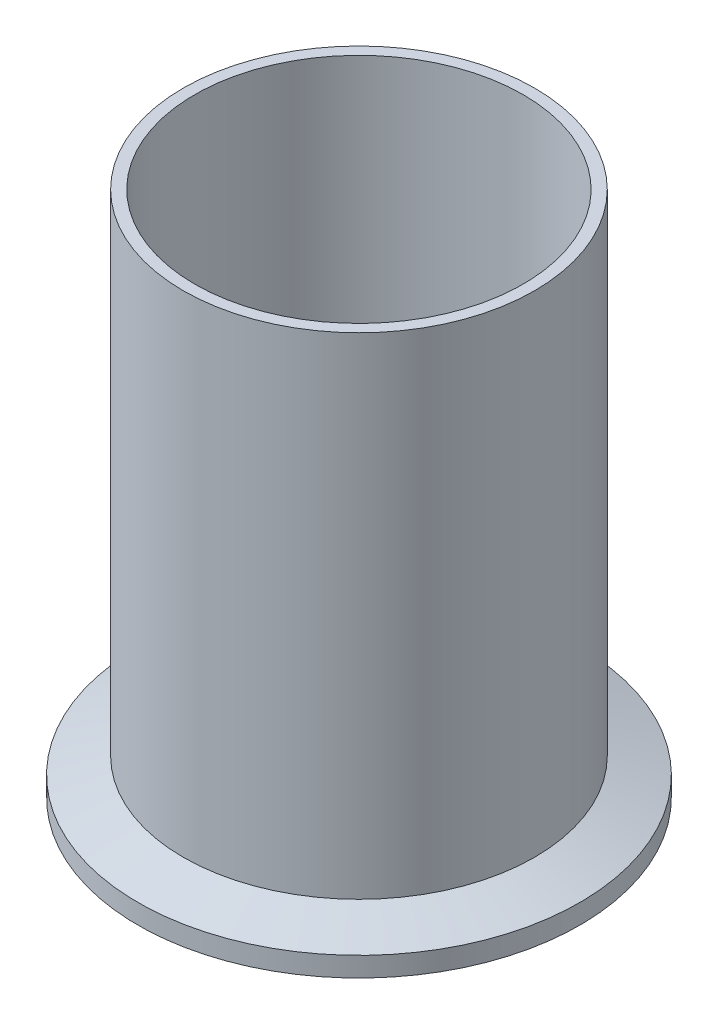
from build123d import *


with BuildPart() as part:
    # Sketch1 → Revolve2 (revolve)
    with BuildSketch(Plane.XY, mode=Mode.PRIVATE) as revolve2_sk:
        with BuildLine():
            Line((-23.749, 0), (-23.749, 76.2))
            Line((-23.749, 76.2), (-25.4, 76.2))
            Line((-25.4, 76.2), (-25.4, 5.229969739))
            Line((-25.4, 5.229969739), (-31.9532, 2.8448))
            Line((-31.9532, 2.8448), (-31.9532, 0))
            Line((-31.9532, 0), (-29.986608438, 0))
            ThreePointArc((-29.986608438, 0), (-29.554411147, 0.129217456), (-29.264066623, 0.474458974))
            ThreePointArc((-29.264066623, 0.474458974), (-28.1686, 1.1938), (-27.073133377, 0.474458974))
            ThreePointArc((-27.073133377, 0.474458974), (-26.782788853, 0.129217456), (-26.350591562, 0))
            Line((-26.350591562, 0), (-23.749, 0))
        make_face()
    revolve(revolve2_sk.sketch.rotate(Axis((0, 0, 0), (0, 1, 0)), 270), axis=Axis((0, 0, 0), (0, 1, 0)))


solid = part.part
